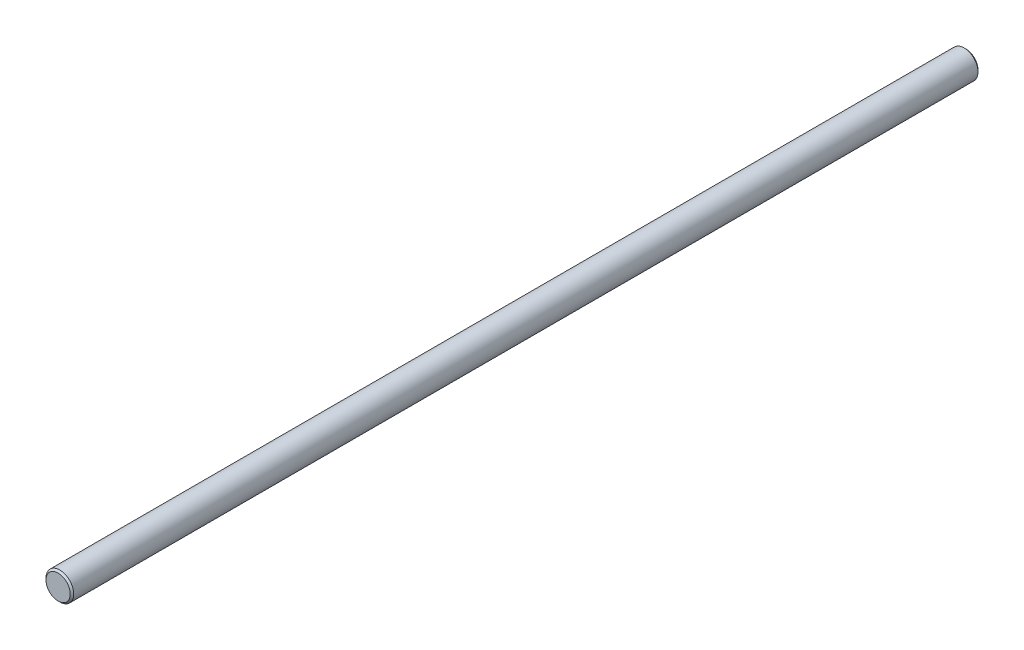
ISO-10303-21;
HEADER;
FILE_DESCRIPTION(('STEP AP214'),'2;1');
FILE_NAME('part.step','',(''),(''),'','','');
FILE_SCHEMA(('AUTOMOTIVE_DESIGN { 1 0 10303 214 1 1 1 1 }'));
ENDSEC;
DATA;
#1=APPLICATION_CONTEXT('core data for automotive mechanical design processes');
#2=APPLICATION_PROTOCOL_DEFINITION('international standard','automotive_design',2000,#1);
#3=PRODUCT_CONTEXT('',#1,'mechanical');
#4=PRODUCT('Part','Part','',(#3));
#5=PRODUCT_RELATED_PRODUCT_CATEGORY('part','',(#4));
#6=PRODUCT_DEFINITION_FORMATION('','',#4);
#7=PRODUCT_DEFINITION_CONTEXT('part definition',#1,'design');
#8=PRODUCT_DEFINITION('design','',#6,#7);
#9=PRODUCT_DEFINITION_SHAPE('','',#8);
#10=(LENGTH_UNIT() NAMED_UNIT(*) SI_UNIT(.MILLI.,.METRE.));
#11=(NAMED_UNIT(*) PLANE_ANGLE_UNIT() SI_UNIT($,.RADIAN.));
#12=(NAMED_UNIT(*) SI_UNIT($,.STERADIAN.) SOLID_ANGLE_UNIT());
#13=UNCERTAINTY_MEASURE_WITH_UNIT(LENGTH_MEASURE(1.E-05),#10,'distance_accuracy_value','');
#14=(GEOMETRIC_REPRESENTATION_CONTEXT(3) GLOBAL_UNCERTAINTY_ASSIGNED_CONTEXT((#13)) GLOBAL_UNIT_ASSIGNED_CONTEXT((#10,
#11,#12)) REPRESENTATION_CONTEXT('',''));
#15=CARTESIAN_POINT('',(0.,0.,0.));
#16=DIRECTION('',(0.,0.,1.));
#17=DIRECTION('',(1.,0.,0.));
#18=AXIS2_PLACEMENT_3D('',#15,#16,#17);
#19=CARTESIAN_POINT('',(0.,0.,-5.));
#20=DIRECTION('',(0.,0.,-1.));
#21=DIRECTION('',(-1.,0.,0.));
#22=AXIS2_PLACEMENT_3D('',#19,#20,#21);
#23=CYLINDRICAL_SURFACE('',#22,4.);
#24=CARTESIAN_POINT('',(0.,0.,-5.49999999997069));
#25=DIRECTION('',(0.,0.,1.));
#26=DIRECTION('',(1.,0.,0.));
#27=AXIS2_PLACEMENT_3D('',#24,#25,#26);
#28=CIRCLE('',#27,4.);
#29=CARTESIAN_POINT('',(4.,0.,-5.49999999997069));
#30=VERTEX_POINT('',#29);
#31=EDGE_CURVE('E42',#30,#30,#28,.F.);
#32=ORIENTED_EDGE('',*,*,#31,.T.);
#33=EDGE_LOOP('',(#32));
#34=FACE_BOUND('',#33,.T.);
#35=CARTESIAN_POINT('',(0.,0.,-266.500000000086));
#36=DIRECTION('',(0.,0.,1.));
#37=DIRECTION('',(1.,0.,0.));
#38=AXIS2_PLACEMENT_3D('',#35,#36,#37);
#39=CIRCLE('',#38,4.);
#40=CARTESIAN_POINT('',(4.,0.,-266.500000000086));
#41=VERTEX_POINT('',#40);
#42=EDGE_CURVE('E46',#41,#41,#39,.T.);
#43=ORIENTED_EDGE('',*,*,#42,.T.);
#44=EDGE_LOOP('',(#43));
#45=FACE_BOUND('',#44,.T.);
#46=ADVANCED_FACE('F31',(#34,#45),#23,.T.);
#47=CARTESIAN_POINT('',(0.,0.,-5.));
#48=DIRECTION('',(0.,0.,1.));
#49=DIRECTION('',(1.,0.,0.));
#50=AXIS2_PLACEMENT_3D('',#47,#48,#49);
#51=PLANE('',#50);
#52=CARTESIAN_POINT('',(0.,0.,-5.));
#53=DIRECTION('',(0.,0.,1.));
#54=DIRECTION('',(1.,0.,0.));
#55=AXIS2_PLACEMENT_3D('',#52,#53,#54);
#56=CIRCLE('',#55,3.50000000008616);
#57=CARTESIAN_POINT('',(3.50000000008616,0.,-5.));
#58=VERTEX_POINT('',#57);
#59=EDGE_CURVE('E38',#58,#58,#56,.T.);
#60=ORIENTED_EDGE('',*,*,#59,.T.);
#61=EDGE_LOOP('',(#60));
#62=FACE_BOUND('',#61,.T.);
#63=ADVANCED_FACE('F62',(#62),#51,.T.);
#64=CARTESIAN_POINT('',(0.,0.,-267.));
#65=DIRECTION('',(0.,0.,1.));
#66=DIRECTION('',(1.,0.,0.));
#67=AXIS2_PLACEMENT_3D('',#64,#65,#66);
#68=PLANE('',#67);
#69=CARTESIAN_POINT('',(0.,0.,-267.));
#70=DIRECTION('',(0.,0.,1.));
#71=DIRECTION('',(1.,0.,0.));
#72=AXIS2_PLACEMENT_3D('',#69,#70,#71);
#73=CIRCLE('',#72,3.50000000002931);
#74=CARTESIAN_POINT('',(3.50000000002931,0.,-267.));
#75=VERTEX_POINT('',#74);
#76=EDGE_CURVE('E10',#75,#75,#73,.F.);
#77=ORIENTED_EDGE('',*,*,#76,.T.);
#78=EDGE_LOOP('',(#77));
#79=FACE_BOUND('',#78,.T.);
#80=ADVANCED_FACE('F59',(#79),#68,.F.);
#81=CARTESIAN_POINT('',(0.,0.,-5.49999999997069));
#82=DIRECTION('',(0.,0.,-1.));
#83=DIRECTION('',(-1.,0.,0.));
#84=AXIS2_PLACEMENT_3D('',#81,#82,#83);
#85=CONICAL_SURFACE('',#84,4.,0.785398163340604);
#86=ORIENTED_EDGE('',*,*,#59,.F.);
#87=EDGE_LOOP('',(#86));
#88=FACE_BOUND('',#87,.T.);
#89=ORIENTED_EDGE('',*,*,#31,.F.);
#90=EDGE_LOOP('',(#89));
#91=FACE_BOUND('',#90,.T.);
#92=ADVANCED_FACE('F55',(#88,#91),#85,.T.);
#93=CARTESIAN_POINT('',(0.,0.,-267.));
#94=DIRECTION('',(0.,0.,1.));
#95=DIRECTION('',(1.,0.,0.));
#96=AXIS2_PLACEMENT_3D('',#93,#94,#95);
#97=CONICAL_SURFACE('',#96,3.50000000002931,0.785398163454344);
#98=ORIENTED_EDGE('',*,*,#42,.F.);
#99=EDGE_LOOP('',(#98));
#100=FACE_BOUND('',#99,.T.);
#101=ORIENTED_EDGE('',*,*,#76,.F.);
#102=EDGE_LOOP('',(#101));
#103=FACE_BOUND('',#102,.T.);
#104=ADVANCED_FACE('F33',(#100,#103),#97,.T.);
#105=CLOSED_SHELL('',(#46,#63,#80,#92,#104));
#106=MANIFOLD_SOLID_BREP('B2',#105);
#107=ADVANCED_BREP_SHAPE_REPRESENTATION('',(#18,#106),#14);
#108=SHAPE_DEFINITION_REPRESENTATION(#9,#107);
ENDSEC;
END-ISO-10303-21;
